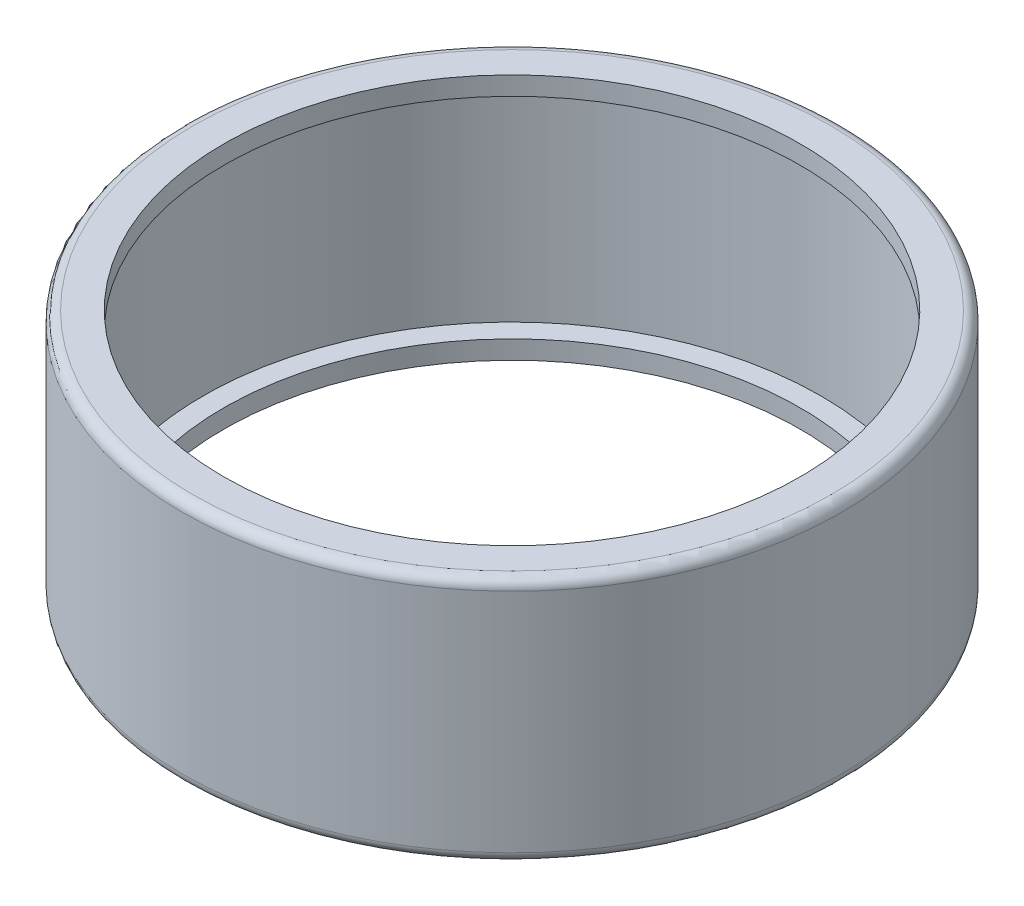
from build123d import *


with BuildPart() as part:
    # Esquisse1 → Base-R_volution (revolve)
    with BuildSketch(Plane.XY, mode=Mode.PRIVATE) as base_r_volution_sk:
        with BuildLine():
            Line((-14, -6), (-14, -5.1))
            Line((-14, -5.1), (-15, -5.1))
            Line((-15, -5.1), (-15, 5.1))
            Line((-15, 5.1), (-14, 5.1))
            Line((-14, 5.1), (-14, 6))
            Line((-14, 6), (-15.5, 6))
            ThreePointArc((-15.5, 6), (-15.853553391, 5.853553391), (-16, 5.5))
            Line((-16, 5.5), (-16, -5.5))
            ThreePointArc((-16, -5.5), (-15.853553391, -5.853553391), (-15.5, -6))
            Line((-15.5, -6), (-14, -6))
        make_face()
    revolve(base_r_volution_sk.sketch.rotate(Axis((0, 7, 0), (0, -1, 0)), 270), axis=Axis((0, 7, 0), (0, -1, 0)))


solid = part.part
